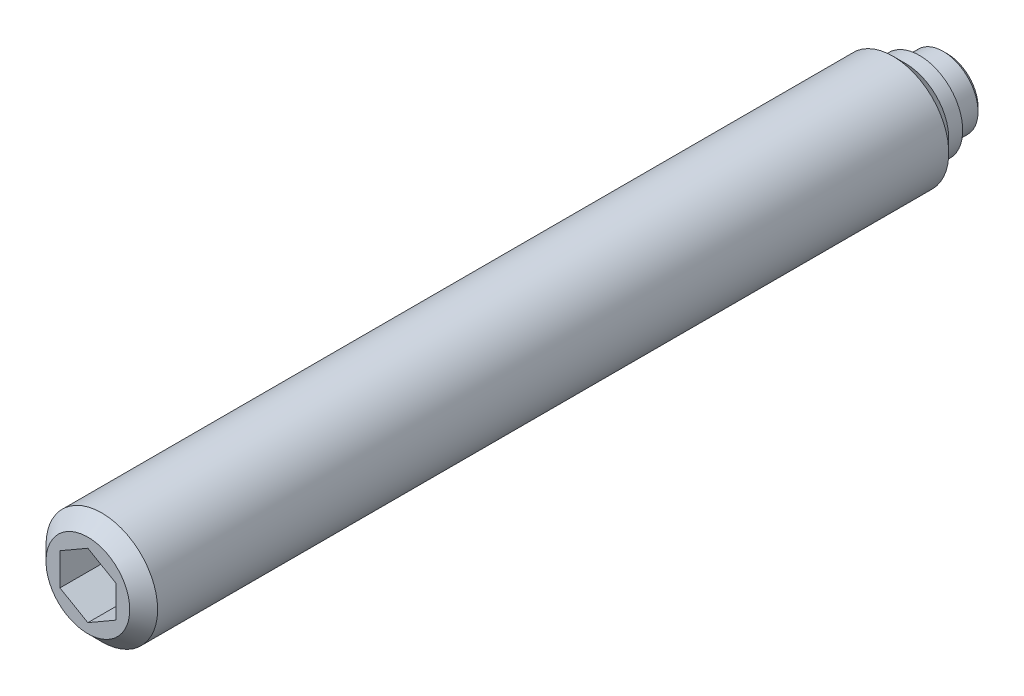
ISO-10303-21;
HEADER;
FILE_DESCRIPTION(('STEP AP214'),'2;1');
FILE_NAME('part.step','',(''),(''),'','','');
FILE_SCHEMA(('AUTOMOTIVE_DESIGN { 1 0 10303 214 1 1 1 1 }'));
ENDSEC;
DATA;
#1=APPLICATION_CONTEXT('core data for automotive mechanical design processes');
#2=APPLICATION_PROTOCOL_DEFINITION('international standard','automotive_design',2000,#1);
#3=PRODUCT_CONTEXT('',#1,'mechanical');
#4=PRODUCT('Part','Part','',(#3));
#5=PRODUCT_RELATED_PRODUCT_CATEGORY('part','',(#4));
#6=PRODUCT_DEFINITION_FORMATION('','',#4);
#7=PRODUCT_DEFINITION_CONTEXT('part definition',#1,'design');
#8=PRODUCT_DEFINITION('design','',#6,#7);
#9=PRODUCT_DEFINITION_SHAPE('','',#8);
#10=(LENGTH_UNIT() NAMED_UNIT(*) SI_UNIT(.MILLI.,.METRE.));
#11=(NAMED_UNIT(*) PLANE_ANGLE_UNIT() SI_UNIT($,.RADIAN.));
#12=(NAMED_UNIT(*) SI_UNIT($,.STERADIAN.) SOLID_ANGLE_UNIT());
#13=UNCERTAINTY_MEASURE_WITH_UNIT(LENGTH_MEASURE(1.E-05),#10,'distance_accuracy_value','');
#14=(GEOMETRIC_REPRESENTATION_CONTEXT(3) GLOBAL_UNCERTAINTY_ASSIGNED_CONTEXT((#13)) GLOBAL_UNIT_ASSIGNED_CONTEXT((#10,
#11,#12)) REPRESENTATION_CONTEXT('',''));
#15=CARTESIAN_POINT('',(0.,0.,0.));
#16=DIRECTION('',(0.,0.,1.));
#17=DIRECTION('',(1.,0.,0.));
#18=AXIS2_PLACEMENT_3D('',#15,#16,#17);
#19=CARTESIAN_POINT('',(0.,0.,0.));
#20=DIRECTION('',(0.,0.,-1.));
#21=DIRECTION('',(-1.,0.,0.));
#22=AXIS2_PLACEMENT_3D('',#19,#20,#21);
#23=CYLINDRICAL_SURFACE('',#22,2.5);
#24=CARTESIAN_POINT('',(0.,0.,0.3));
#25=DIRECTION('',(0.,0.,-1.));
#26=DIRECTION('',(-1.,0.,0.));
#27=AXIS2_PLACEMENT_3D('',#24,#25,#26);
#28=CIRCLE('',#27,2.5);
#29=CARTESIAN_POINT('',(-2.5,0.,0.3));
#30=VERTEX_POINT('',#29);
#31=EDGE_CURVE('E133',#30,#30,#28,.T.);
#32=ORIENTED_EDGE('',*,*,#31,.F.);
#33=EDGE_LOOP('',(#32));
#34=FACE_BOUND('',#33,.T.);
#35=CARTESIAN_POINT('',(0.,0.,2.));
#36=DIRECTION('',(0.,0.,-1.));
#37=DIRECTION('',(-1.,0.,0.));
#38=AXIS2_PLACEMENT_3D('',#35,#36,#37);
#39=CIRCLE('',#38,2.5);
#40=CARTESIAN_POINT('',(-2.5,0.,2.));
#41=VERTEX_POINT('',#40);
#42=EDGE_CURVE('E127',#41,#41,#39,.T.);
#43=ORIENTED_EDGE('',*,*,#42,.T.);
#44=EDGE_LOOP('',(#43));
#45=FACE_BOUND('',#44,.T.);
#46=ADVANCED_FACE('F14',(#34,#45),#23,.T.);
#47=CARTESIAN_POINT('',(0.,0.,0.3));
#48=DIRECTION('',(0.,0.,1.));
#49=DIRECTION('',(1.,0.,0.));
#50=AXIS2_PLACEMENT_3D('',#47,#48,#49);
#51=CONICAL_SURFACE('',#50,2.5,0.785398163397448);
#52=CARTESIAN_POINT('',(0.,0.,0.));
#53=DIRECTION('',(0.,0.,-1.));
#54=DIRECTION('',(-1.,0.,0.));
#55=AXIS2_PLACEMENT_3D('',#52,#53,#54);
#56=CIRCLE('',#55,2.2);
#57=CARTESIAN_POINT('',(-2.2,0.,0.));
#58=VERTEX_POINT('',#57);
#59=EDGE_CURVE('E130',#58,#58,#56,.T.);
#60=ORIENTED_EDGE('',*,*,#59,.F.);
#61=EDGE_LOOP('',(#60));
#62=FACE_BOUND('',#61,.T.);
#63=ORIENTED_EDGE('',*,*,#31,.T.);
#64=EDGE_LOOP('',(#63));
#65=FACE_BOUND('',#64,.T.);
#66=ADVANCED_FACE('F159',(#62,#65),#51,.T.);
#67=CARTESIAN_POINT('',(0.,2.2,0.));
#68=DIRECTION('',(0.,0.,1.));
#69=DIRECTION('',(1.,0.,0.));
#70=AXIS2_PLACEMENT_3D('',#67,#68,#69);
#71=PLANE('',#70);
#72=ORIENTED_EDGE('',*,*,#59,.T.);
#73=EDGE_LOOP('',(#72));
#74=FACE_BOUND('',#73,.T.);
#75=ADVANCED_FACE('F165',(#74),#71,.F.);
#76=CARTESIAN_POINT('',(0.,0.,2.));
#77=DIRECTION('',(0.,0.,-1.));
#78=DIRECTION('',(-1.,0.,0.));
#79=AXIS2_PLACEMENT_3D('',#76,#77,#78);
#80=CYLINDRICAL_SURFACE('',#79,4.);
#81=CARTESIAN_POINT('',(0.,0.,3.9));
#82=DIRECTION('',(0.,0.,-1.));
#83=DIRECTION('',(-1.,0.,0.));
#84=AXIS2_PLACEMENT_3D('',#81,#82,#83);
#85=CIRCLE('',#84,4.);
#86=CARTESIAN_POINT('',(-4.,0.,3.9));
#87=VERTEX_POINT('',#86);
#88=EDGE_CURVE('E9',#87,#87,#85,.T.);
#89=ORIENTED_EDGE('',*,*,#88,.F.);
#90=EDGE_LOOP('',(#89));
#91=FACE_BOUND('',#90,.T.);
#92=CARTESIAN_POINT('',(0.,0.,60.6));
#93=DIRECTION('',(0.,0.,1.));
#94=DIRECTION('',(1.,0.,0.));
#95=AXIS2_PLACEMENT_3D('',#92,#93,#94);
#96=CIRCLE('',#95,4.);
#97=CARTESIAN_POINT('',(4.,0.,60.6));
#98=VERTEX_POINT('',#97);
#99=EDGE_CURVE('E124',#98,#98,#96,.T.);
#100=ORIENTED_EDGE('',*,*,#99,.F.);
#101=EDGE_LOOP('',(#100));
#102=FACE_BOUND('',#101,.T.);
#103=ADVANCED_FACE('F16',(#91,#102),#80,.T.);
#104=CARTESIAN_POINT('',(0.,3.1,2.));
#105=DIRECTION('',(0.,0.,1.));
#106=DIRECTION('',(1.,0.,0.));
#107=AXIS2_PLACEMENT_3D('',#104,#105,#106);
#108=PLANE('',#107);
#109=CARTESIAN_POINT('',(0.,0.,2.));
#110=DIRECTION('',(0.,0.,-1.));
#111=DIRECTION('',(-1.,0.,0.));
#112=AXIS2_PLACEMENT_3D('',#109,#110,#111);
#113=CIRCLE('',#112,3.1);
#114=CARTESIAN_POINT('',(-3.1,0.,2.));
#115=VERTEX_POINT('',#114);
#116=EDGE_CURVE('E136',#115,#115,#113,.T.);
#117=ORIENTED_EDGE('',*,*,#116,.T.);
#118=EDGE_LOOP('',(#117));
#119=FACE_BOUND('',#118,.T.);
#120=ORIENTED_EDGE('',*,*,#42,.F.);
#121=EDGE_LOOP('',(#120));
#122=FACE_BOUND('',#121,.T.);
#123=ADVANCED_FACE('F156',(#119,#122),#108,.F.);
#124=CARTESIAN_POINT('',(0.,0.,2.));
#125=DIRECTION('',(0.,0.,-1.));
#126=DIRECTION('',(-1.,0.,0.));
#127=AXIS2_PLACEMENT_3D('',#124,#125,#126);
#128=CYLINDRICAL_SURFACE('',#127,3.1);
#129=CARTESIAN_POINT('',(0.,0.,3.));
#130=DIRECTION('',(0.,0.,-1.));
#131=DIRECTION('',(-1.,0.,0.));
#132=AXIS2_PLACEMENT_3D('',#129,#130,#131);
#133=CIRCLE('',#132,3.1);
#134=CARTESIAN_POINT('',(-3.1,0.,3.));
#135=VERTEX_POINT('',#134);
#136=EDGE_CURVE('E22',#135,#135,#133,.T.);
#137=ORIENTED_EDGE('',*,*,#136,.T.);
#138=EDGE_LOOP('',(#137));
#139=FACE_BOUND('',#138,.T.);
#140=ORIENTED_EDGE('',*,*,#116,.F.);
#141=EDGE_LOOP('',(#140));
#142=FACE_BOUND('',#141,.T.);
#143=ADVANCED_FACE('F141',(#139,#142),#128,.T.);
#144=CARTESIAN_POINT('',(0.,0.,3.9));
#145=DIRECTION('',(0.,0.,1.));
#146=DIRECTION('',(1.,0.,0.));
#147=AXIS2_PLACEMENT_3D('',#144,#145,#146);
#148=CONICAL_SURFACE('',#147,4.,0.78539816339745);
#149=ORIENTED_EDGE('',*,*,#88,.T.);
#150=EDGE_LOOP('',(#149));
#151=FACE_BOUND('',#150,.T.);
#152=ORIENTED_EDGE('',*,*,#136,.F.);
#153=EDGE_LOOP('',(#152));
#154=FACE_BOUND('',#153,.T.);
#155=ADVANCED_FACE('F144',(#151,#154),#148,.T.);
#156=CARTESIAN_POINT('',(0.,-3.,61.6));
#157=DIRECTION('',(0.,0.,1.));
#158=DIRECTION('',(1.,0.,0.));
#159=AXIS2_PLACEMENT_3D('',#156,#157,#158);
#160=PLANE('',#159);
#161=DIRECTION('',(0.866025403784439,-0.5,0.));
#162=VECTOR('',#161,1.);
#163=CARTESIAN_POINT('',(-2.,-1.15470053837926,61.6));
#164=LINE('',#163,#162);
#165=CARTESIAN_POINT('',(-2.,-1.15470053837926,61.6));
#166=VERTEX_POINT('',#165);
#167=CARTESIAN_POINT('',(0.,-2.30940107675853,61.6));
#168=VERTEX_POINT('',#167);
#169=EDGE_CURVE('E29',#166,#168,#164,.T.);
#170=ORIENTED_EDGE('',*,*,#169,.F.);
#171=DIRECTION('',(0.,-1.,0.));
#172=VECTOR('',#171,1.);
#173=CARTESIAN_POINT('',(-2.,1.15470053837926,61.6));
#174=LINE('',#173,#172);
#175=CARTESIAN_POINT('',(-2.,1.15470053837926,61.6));
#176=VERTEX_POINT('',#175);
#177=EDGE_CURVE('E112',#176,#166,#174,.T.);
#178=ORIENTED_EDGE('',*,*,#177,.F.);
#179=DIRECTION('',(-0.866025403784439,-0.5,0.));
#180=VECTOR('',#179,1.);
#181=CARTESIAN_POINT('',(0.,2.30940107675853,61.6));
#182=LINE('',#181,#180);
#183=CARTESIAN_POINT('',(0.,2.30940107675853,61.6));
#184=VERTEX_POINT('',#183);
#185=EDGE_CURVE('E110',#184,#176,#182,.T.);
#186=ORIENTED_EDGE('',*,*,#185,.F.);
#187=DIRECTION('',(-0.866025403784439,0.5,0.));
#188=VECTOR('',#187,1.);
#189=CARTESIAN_POINT('',(2.,1.15470053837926,61.6));
#190=LINE('',#189,#188);
#191=CARTESIAN_POINT('',(2.,1.15470053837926,61.6));
#192=VERTEX_POINT('',#191);
#193=EDGE_CURVE('E77',#192,#184,#190,.T.);
#194=ORIENTED_EDGE('',*,*,#193,.F.);
#195=DIRECTION('',(0.,1.,0.));
#196=VECTOR('',#195,1.);
#197=CARTESIAN_POINT('',(2.,-1.15470053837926,61.6));
#198=LINE('',#197,#196);
#199=CARTESIAN_POINT('',(2.,-1.15470053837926,61.6));
#200=VERTEX_POINT('',#199);
#201=EDGE_CURVE('E106',#200,#192,#198,.T.);
#202=ORIENTED_EDGE('',*,*,#201,.F.);
#203=DIRECTION('',(0.866025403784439,0.5,0.));
#204=VECTOR('',#203,1.);
#205=CARTESIAN_POINT('',(0.,-2.30940107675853,61.6));
#206=LINE('',#205,#204);
#207=EDGE_CURVE('E103',#168,#200,#206,.T.);
#208=ORIENTED_EDGE('',*,*,#207,.F.);
#209=EDGE_LOOP('',(#170,#178,#186,#194,#202,#208));
#210=FACE_BOUND('',#209,.T.);
#211=CARTESIAN_POINT('',(0.,0.,61.6));
#212=DIRECTION('',(0.,0.,1.));
#213=DIRECTION('',(1.,0.,0.));
#214=AXIS2_PLACEMENT_3D('',#211,#212,#213);
#215=CIRCLE('',#214,3.);
#216=CARTESIAN_POINT('',(3.,0.,61.6));
#217=VERTEX_POINT('',#216);
#218=EDGE_CURVE('E116',#217,#217,#215,.T.);
#219=ORIENTED_EDGE('',*,*,#218,.T.);
#220=EDGE_LOOP('',(#219));
#221=FACE_BOUND('',#220,.T.);
#222=ADVANCED_FACE('F146',(#210,#221),#160,.T.);
#223=CARTESIAN_POINT('',(0.,0.,61.6));
#224=DIRECTION('',(0.,0.,-1.));
#225=DIRECTION('',(-1.,0.,0.));
#226=AXIS2_PLACEMENT_3D('',#223,#224,#225);
#227=CONICAL_SURFACE('',#226,3.,0.785398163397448);
#228=ORIENTED_EDGE('',*,*,#99,.T.);
#229=EDGE_LOOP('',(#228));
#230=FACE_BOUND('',#229,.T.);
#231=ORIENTED_EDGE('',*,*,#218,.F.);
#232=EDGE_LOOP('',(#231));
#233=FACE_BOUND('',#232,.T.);
#234=ADVANCED_FACE('F153',(#230,#233),#227,.T.);
#235=CARTESIAN_POINT('',(-2.,-1.15470053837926,56.6));
#236=DIRECTION('',(-0.5,-0.866025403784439,0.));
#237=DIRECTION('',(0.866025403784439,-0.5,0.));
#238=AXIS2_PLACEMENT_3D('',#235,#236,#237);
#239=PLANE('',#238);
#240=ORIENTED_EDGE('',*,*,#169,.T.);
#241=DIRECTION('',(0.,0.,1.));
#242=VECTOR('',#241,1.);
#243=CARTESIAN_POINT('',(0.,-2.30940107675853,56.6));
#244=LINE('',#243,#242);
#245=CARTESIAN_POINT('',(0.,-2.30940107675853,56.6));
#246=VERTEX_POINT('',#245);
#247=EDGE_CURVE('E59',#246,#168,#244,.T.);
#248=ORIENTED_EDGE('',*,*,#247,.F.);
#249=DIRECTION('',(0.866025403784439,-0.5,0.));
#250=VECTOR('',#249,1.);
#251=CARTESIAN_POINT('',(-2.,-1.15470053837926,56.6));
#252=LINE('',#251,#250);
#253=CARTESIAN_POINT('',(-2.,-1.15470053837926,56.6));
#254=VERTEX_POINT('',#253);
#255=EDGE_CURVE('E114',#254,#246,#252,.T.);
#256=ORIENTED_EDGE('',*,*,#255,.F.);
#257=DIRECTION('',(0.,0.,1.));
#258=VECTOR('',#257,1.);
#259=CARTESIAN_POINT('',(-2.,-1.15470053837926,56.6));
#260=LINE('',#259,#258);
#261=EDGE_CURVE('E37',#254,#166,#260,.T.);
#262=ORIENTED_EDGE('',*,*,#261,.T.);
#263=EDGE_LOOP('',(#240,#248,#256,#262));
#264=FACE_BOUND('',#263,.T.);
#265=ADVANCED_FACE('F191',(#264),#239,.F.);
#266=CARTESIAN_POINT('',(-2.,1.15470053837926,56.6));
#267=DIRECTION('',(-1.,0.,0.));
#268=DIRECTION('',(0.,0.,1.));
#269=AXIS2_PLACEMENT_3D('',#266,#267,#268);
#270=PLANE('',#269);
#271=ORIENTED_EDGE('',*,*,#177,.T.);
#272=ORIENTED_EDGE('',*,*,#261,.F.);
#273=DIRECTION('',(0.,-1.,0.));
#274=VECTOR('',#273,1.);
#275=CARTESIAN_POINT('',(-2.,1.15470053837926,56.6));
#276=LINE('',#275,#274);
#277=CARTESIAN_POINT('',(-2.,1.15470053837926,56.6));
#278=VERTEX_POINT('',#277);
#279=EDGE_CURVE('E89',#278,#254,#276,.T.);
#280=ORIENTED_EDGE('',*,*,#279,.F.);
#281=DIRECTION('',(0.,0.,1.));
#282=VECTOR('',#281,1.);
#283=CARTESIAN_POINT('',(-2.,1.15470053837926,56.6));
#284=LINE('',#283,#282);
#285=EDGE_CURVE('E81',#278,#176,#284,.T.);
#286=ORIENTED_EDGE('',*,*,#285,.T.);
#287=EDGE_LOOP('',(#271,#272,#280,#286));
#288=FACE_BOUND('',#287,.T.);
#289=ADVANCED_FACE('F198',(#288),#270,.F.);
#290=CARTESIAN_POINT('',(0.,2.30940107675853,56.6));
#291=DIRECTION('',(-0.5,0.866025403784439,0.));
#292=DIRECTION('',(-0.866025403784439,-0.5,0.));
#293=AXIS2_PLACEMENT_3D('',#290,#291,#292);
#294=PLANE('',#293);
#295=ORIENTED_EDGE('',*,*,#185,.T.);
#296=ORIENTED_EDGE('',*,*,#285,.F.);
#297=DIRECTION('',(-0.866025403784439,-0.5,0.));
#298=VECTOR('',#297,1.);
#299=CARTESIAN_POINT('',(0.,2.30940107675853,56.6));
#300=LINE('',#299,#298);
#301=CARTESIAN_POINT('',(0.,2.30940107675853,56.6));
#302=VERTEX_POINT('',#301);
#303=EDGE_CURVE('E85',#302,#278,#300,.T.);
#304=ORIENTED_EDGE('',*,*,#303,.F.);
#305=DIRECTION('',(0.,0.,1.));
#306=VECTOR('',#305,1.);
#307=CARTESIAN_POINT('',(0.,2.30940107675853,56.6));
#308=LINE('',#307,#306);
#309=EDGE_CURVE('E70',#302,#184,#308,.T.);
#310=ORIENTED_EDGE('',*,*,#309,.T.);
#311=EDGE_LOOP('',(#295,#296,#304,#310));
#312=FACE_BOUND('',#311,.T.);
#313=ADVANCED_FACE('F86',(#312),#294,.F.);
#314=CARTESIAN_POINT('',(2.,1.15470053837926,56.6));
#315=DIRECTION('',(0.5,0.866025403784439,0.));
#316=DIRECTION('',(-0.866025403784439,0.5,0.));
#317=AXIS2_PLACEMENT_3D('',#314,#315,#316);
#318=PLANE('',#317);
#319=ORIENTED_EDGE('',*,*,#193,.T.);
#320=ORIENTED_EDGE('',*,*,#309,.F.);
#321=DIRECTION('',(-0.866025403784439,0.5,0.));
#322=VECTOR('',#321,1.);
#323=CARTESIAN_POINT('',(2.,1.15470053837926,56.6));
#324=LINE('',#323,#322);
#325=CARTESIAN_POINT('',(2.,1.15470053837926,56.6));
#326=VERTEX_POINT('',#325);
#327=EDGE_CURVE('E74',#326,#302,#324,.T.);
#328=ORIENTED_EDGE('',*,*,#327,.F.);
#329=DIRECTION('',(0.,0.,1.));
#330=VECTOR('',#329,1.);
#331=CARTESIAN_POINT('',(2.,1.15470053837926,56.6));
#332=LINE('',#331,#330);
#333=EDGE_CURVE('E82',#326,#192,#332,.T.);
#334=ORIENTED_EDGE('',*,*,#333,.T.);
#335=EDGE_LOOP('',(#319,#320,#328,#334));
#336=FACE_BOUND('',#335,.T.);
#337=ADVANCED_FACE('F72',(#336),#318,.F.);
#338=CARTESIAN_POINT('',(2.,-1.15470053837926,56.6));
#339=DIRECTION('',(1.,0.,0.));
#340=DIRECTION('',(0.,0.,-1.));
#341=AXIS2_PLACEMENT_3D('',#338,#339,#340);
#342=PLANE('',#341);
#343=ORIENTED_EDGE('',*,*,#201,.T.);
#344=ORIENTED_EDGE('',*,*,#333,.F.);
#345=DIRECTION('',(0.,1.,0.));
#346=VECTOR('',#345,1.);
#347=CARTESIAN_POINT('',(2.,-1.15470053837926,56.6));
#348=LINE('',#347,#346);
#349=CARTESIAN_POINT('',(2.,-1.15470053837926,56.6));
#350=VERTEX_POINT('',#349);
#351=EDGE_CURVE('E95',#350,#326,#348,.T.);
#352=ORIENTED_EDGE('',*,*,#351,.F.);
#353=DIRECTION('',(0.,0.,1.));
#354=VECTOR('',#353,1.);
#355=CARTESIAN_POINT('',(2.,-1.15470053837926,56.6));
#356=LINE('',#355,#354);
#357=EDGE_CURVE('E119',#350,#200,#356,.T.);
#358=ORIENTED_EDGE('',*,*,#357,.T.);
#359=EDGE_LOOP('',(#343,#344,#352,#358));
#360=FACE_BOUND('',#359,.T.);
#361=ADVANCED_FACE('F204',(#360),#342,.F.);
#362=CARTESIAN_POINT('',(0.,-2.30940107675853,56.6));
#363=DIRECTION('',(0.5,-0.866025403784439,0.));
#364=DIRECTION('',(0.866025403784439,0.5,0.));
#365=AXIS2_PLACEMENT_3D('',#362,#363,#364);
#366=PLANE('',#365);
#367=ORIENTED_EDGE('',*,*,#207,.T.);
#368=ORIENTED_EDGE('',*,*,#357,.F.);
#369=DIRECTION('',(0.866025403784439,0.5,0.));
#370=VECTOR('',#369,1.);
#371=CARTESIAN_POINT('',(0.,-2.30940107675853,56.6));
#372=LINE('',#371,#370);
#373=EDGE_CURVE('E97',#246,#350,#372,.T.);
#374=ORIENTED_EDGE('',*,*,#373,.F.);
#375=ORIENTED_EDGE('',*,*,#247,.T.);
#376=EDGE_LOOP('',(#367,#368,#374,#375));
#377=FACE_BOUND('',#376,.T.);
#378=ADVANCED_FACE('F201',(#377),#366,.F.);
#379=CARTESIAN_POINT('',(0.,0.,56.6));
#380=DIRECTION('',(0.,0.,1.));
#381=DIRECTION('',(1.,0.,0.));
#382=AXIS2_PLACEMENT_3D('',#379,#380,#381);
#383=PLANE('',#382);
#384=ORIENTED_EDGE('',*,*,#255,.T.);
#385=ORIENTED_EDGE('',*,*,#373,.T.);
#386=ORIENTED_EDGE('',*,*,#351,.T.);
#387=ORIENTED_EDGE('',*,*,#327,.T.);
#388=ORIENTED_EDGE('',*,*,#303,.T.);
#389=ORIENTED_EDGE('',*,*,#279,.T.);
#390=EDGE_LOOP('',(#384,#385,#386,#387,#388,#389));
#391=FACE_BOUND('',#390,.T.);
#392=ADVANCED_FACE('F92',(#391),#383,.T.);
#393=CLOSED_SHELL('',(#46,#66,#75,#103,#123,#143,#155,#222,#234,#265,#289,#313,#337,#361,#378,#392));
#394=MANIFOLD_SOLID_BREP('B1',#393);
#395=ADVANCED_BREP_SHAPE_REPRESENTATION('',(#18,#394),#14);
#396=SHAPE_DEFINITION_REPRESENTATION(#9,#395);
ENDSEC;
END-ISO-10303-21;
